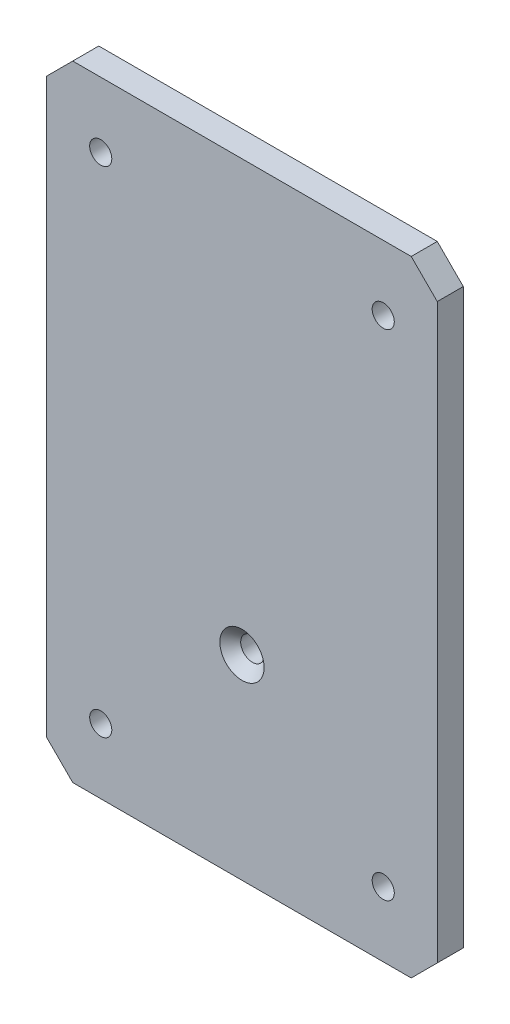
ISO-10303-21;
HEADER;
FILE_DESCRIPTION(('STEP AP214'),'2;1');
FILE_NAME('part.step','',(''),(''),'','','');
FILE_SCHEMA(('AUTOMOTIVE_DESIGN { 1 0 10303 214 1 1 1 1 }'));
ENDSEC;
DATA;
#1=APPLICATION_CONTEXT('core data for automotive mechanical design processes');
#2=APPLICATION_PROTOCOL_DEFINITION('international standard','automotive_design',2000,#1);
#3=PRODUCT_CONTEXT('',#1,'mechanical');
#4=PRODUCT('Part','Part','',(#3));
#5=PRODUCT_RELATED_PRODUCT_CATEGORY('part','',(#4));
#6=PRODUCT_DEFINITION_FORMATION('','',#4);
#7=PRODUCT_DEFINITION_CONTEXT('part definition',#1,'design');
#8=PRODUCT_DEFINITION('design','',#6,#7);
#9=PRODUCT_DEFINITION_SHAPE('','',#8);
#10=(LENGTH_UNIT() NAMED_UNIT(*) SI_UNIT(.MILLI.,.METRE.));
#11=(NAMED_UNIT(*) PLANE_ANGLE_UNIT() SI_UNIT($,.RADIAN.));
#12=(NAMED_UNIT(*) SI_UNIT($,.STERADIAN.) SOLID_ANGLE_UNIT());
#13=UNCERTAINTY_MEASURE_WITH_UNIT(LENGTH_MEASURE(1.E-05),#10,'distance_accuracy_value','');
#14=(GEOMETRIC_REPRESENTATION_CONTEXT(3) GLOBAL_UNCERTAINTY_ASSIGNED_CONTEXT((#13)) GLOBAL_UNIT_ASSIGNED_CONTEXT((#10,
#11,#12)) REPRESENTATION_CONTEXT('',''));
#15=CARTESIAN_POINT('',(0.,0.,0.));
#16=DIRECTION('',(0.,0.,1.));
#17=DIRECTION('',(1.,0.,0.));
#18=AXIS2_PLACEMENT_3D('',#15,#16,#17);
#19=CARTESIAN_POINT('',(150.,240.,10.));
#20=DIRECTION('',(0.,0.,-1.));
#21=DIRECTION('',(-1.,0.,0.));
#22=AXIS2_PLACEMENT_3D('',#19,#20,#21);
#23=PLANE('',#22);
#24=CARTESIAN_POINT('',(75.,75.,10.));
#25=DIRECTION('',(0.,0.,-1.));
#26=DIRECTION('',(-1.,0.,0.));
#27=AXIS2_PLACEMENT_3D('',#24,#25,#26);
#28=CIRCLE('',#27,8.50000000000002);
#29=CARTESIAN_POINT('',(66.5,75.,10.));
#30=VERTEX_POINT('',#29);
#31=EDGE_CURVE('E11',#30,#30,#28,.T.);
#32=ORIENTED_EDGE('',*,*,#31,.T.);
#33=EDGE_LOOP('',(#32));
#34=FACE_BOUND('',#33,.T.);
#35=CARTESIAN_POINT('',(129.25,25.,10.));
#36=DIRECTION('',(0.,0.,1.));
#37=DIRECTION('',(1.,0.,0.));
#38=AXIS2_PLACEMENT_3D('',#35,#36,#37);
#39=CIRCLE('',#38,4.25);
#40=CARTESIAN_POINT('',(133.5,25.,10.));
#41=VERTEX_POINT('',#40);
#42=EDGE_CURVE('E292',#41,#41,#39,.T.);
#43=ORIENTED_EDGE('',*,*,#42,.F.);
#44=EDGE_LOOP('',(#43));
#45=FACE_BOUND('',#44,.T.);
#46=CARTESIAN_POINT('',(129.25,215.,10.));
#47=DIRECTION('',(0.,0.,1.));
#48=DIRECTION('',(1.,0.,0.));
#49=AXIS2_PLACEMENT_3D('',#46,#47,#48);
#50=CIRCLE('',#49,4.25000000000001);
#51=CARTESIAN_POINT('',(133.5,215.,10.));
#52=VERTEX_POINT('',#51);
#53=EDGE_CURVE('E311',#52,#52,#50,.T.);
#54=ORIENTED_EDGE('',*,*,#53,.F.);
#55=EDGE_LOOP('',(#54));
#56=FACE_BOUND('',#55,.T.);
#57=DIRECTION('',(0.,1.,0.));
#58=VECTOR('',#57,1.);
#59=CARTESIAN_POINT('',(150.,10.,10.));
#60=LINE('',#59,#58);
#61=CARTESIAN_POINT('',(150.,10.,10.));
#62=VERTEX_POINT('',#61);
#63=CARTESIAN_POINT('',(150.,230.,10.));
#64=VERTEX_POINT('',#63);
#65=EDGE_CURVE('E134',#62,#64,#60,.T.);
#66=ORIENTED_EDGE('',*,*,#65,.T.);
#67=DIRECTION('',(-0.707106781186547,0.707106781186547,0.));
#68=VECTOR('',#67,1.);
#69=CARTESIAN_POINT('',(150.,230.,10.));
#70=LINE('',#69,#68);
#71=CARTESIAN_POINT('',(140.,240.,10.));
#72=VERTEX_POINT('',#71);
#73=EDGE_CURVE('E109',#64,#72,#70,.T.);
#74=ORIENTED_EDGE('',*,*,#73,.T.);
#75=DIRECTION('',(-1.,0.,0.));
#76=VECTOR('',#75,1.);
#77=CARTESIAN_POINT('',(10.,240.,10.));
#78=LINE('',#77,#76);
#79=CARTESIAN_POINT('',(10.,240.,10.));
#80=VERTEX_POINT('',#79);
#81=EDGE_CURVE('E137',#72,#80,#78,.T.);
#82=ORIENTED_EDGE('',*,*,#81,.T.);
#83=DIRECTION('',(-0.707106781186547,-0.707106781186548,0.));
#84=VECTOR('',#83,1.);
#85=CARTESIAN_POINT('',(0.,230.,10.));
#86=LINE('',#85,#84);
#87=CARTESIAN_POINT('',(0.,230.,10.));
#88=VERTEX_POINT('',#87);
#89=EDGE_CURVE('E139',#80,#88,#86,.T.);
#90=ORIENTED_EDGE('',*,*,#89,.T.);
#91=DIRECTION('',(0.,-1.,0.));
#92=VECTOR('',#91,1.);
#93=CARTESIAN_POINT('',(0.,10.,10.));
#94=LINE('',#93,#92);
#95=CARTESIAN_POINT('',(0.,10.,10.));
#96=VERTEX_POINT('',#95);
#97=EDGE_CURVE('E141',#88,#96,#94,.T.);
#98=ORIENTED_EDGE('',*,*,#97,.T.);
#99=DIRECTION('',(0.707106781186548,-0.707106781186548,0.));
#100=VECTOR('',#99,1.);
#101=CARTESIAN_POINT('',(10.,0.,10.));
#102=LINE('',#101,#100);
#103=CARTESIAN_POINT('',(10.,0.,10.));
#104=VERTEX_POINT('',#103);
#105=EDGE_CURVE('E143',#96,#104,#102,.T.);
#106=ORIENTED_EDGE('',*,*,#105,.T.);
#107=DIRECTION('',(1.,0.,0.));
#108=VECTOR('',#107,1.);
#109=CARTESIAN_POINT('',(10.,0.,10.));
#110=LINE('',#109,#108);
#111=CARTESIAN_POINT('',(140.,0.,10.));
#112=VERTEX_POINT('',#111);
#113=EDGE_CURVE('E48',#104,#112,#110,.T.);
#114=ORIENTED_EDGE('',*,*,#113,.T.);
#115=DIRECTION('',(0.707106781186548,0.707106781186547,0.));
#116=VECTOR('',#115,1.);
#117=CARTESIAN_POINT('',(140.,0.,10.));
#118=LINE('',#117,#116);
#119=EDGE_CURVE('E43',#112,#62,#118,.T.);
#120=ORIENTED_EDGE('',*,*,#119,.T.);
#121=EDGE_LOOP('',(#66,#74,#82,#90,#98,#106,#114,#120));
#122=FACE_BOUND('',#121,.T.);
#123=CARTESIAN_POINT('',(20.75,215.,10.));
#124=DIRECTION('',(0.,0.,1.));
#125=DIRECTION('',(1.,0.,0.));
#126=AXIS2_PLACEMENT_3D('',#123,#124,#125);
#127=CIRCLE('',#126,4.25);
#128=CARTESIAN_POINT('',(25.,215.,10.));
#129=VERTEX_POINT('',#128);
#130=EDGE_CURVE('E116',#129,#129,#127,.T.);
#131=ORIENTED_EDGE('',*,*,#130,.F.);
#132=EDGE_LOOP('',(#131));
#133=FACE_BOUND('',#132,.T.);
#134=CARTESIAN_POINT('',(20.75,25.,10.));
#135=DIRECTION('',(0.,0.,1.));
#136=DIRECTION('',(1.,0.,0.));
#137=AXIS2_PLACEMENT_3D('',#134,#135,#136);
#138=CIRCLE('',#137,4.25);
#139=CARTESIAN_POINT('',(25.,25.,10.));
#140=VERTEX_POINT('',#139);
#141=EDGE_CURVE('E305',#140,#140,#138,.T.);
#142=ORIENTED_EDGE('',*,*,#141,.F.);
#143=EDGE_LOOP('',(#142));
#144=FACE_BOUND('',#143,.T.);
#145=ADVANCED_FACE('F28',(#34,#45,#56,#122,#133,#144),#23,.F.);
#146=CARTESIAN_POINT('',(150.,240.,0.));
#147=DIRECTION('',(0.,0.,-1.));
#148=DIRECTION('',(-1.,0.,0.));
#149=AXIS2_PLACEMENT_3D('',#146,#147,#148);
#150=PLANE('',#149);
#151=CARTESIAN_POINT('',(129.25,25.,0.));
#152=DIRECTION('',(0.,0.,1.));
#153=DIRECTION('',(1.,0.,0.));
#154=AXIS2_PLACEMENT_3D('',#151,#152,#153);
#155=CIRCLE('',#154,4.25);
#156=CARTESIAN_POINT('',(133.5,25.,0.));
#157=VERTEX_POINT('',#156);
#158=EDGE_CURVE('E295',#157,#157,#155,.T.);
#159=ORIENTED_EDGE('',*,*,#158,.T.);
#160=EDGE_LOOP('',(#159));
#161=FACE_BOUND('',#160,.T.);
#162=CARTESIAN_POINT('',(129.25,215.,0.));
#163=DIRECTION('',(0.,0.,1.));
#164=DIRECTION('',(1.,0.,0.));
#165=AXIS2_PLACEMENT_3D('',#162,#163,#164);
#166=CIRCLE('',#165,4.25000000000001);
#167=CARTESIAN_POINT('',(133.5,215.,0.));
#168=VERTEX_POINT('',#167);
#169=EDGE_CURVE('E308',#168,#168,#166,.T.);
#170=ORIENTED_EDGE('',*,*,#169,.T.);
#171=EDGE_LOOP('',(#170));
#172=FACE_BOUND('',#171,.T.);
#173=DIRECTION('',(0.,1.,0.));
#174=VECTOR('',#173,1.);
#175=CARTESIAN_POINT('',(150.,10.,0.));
#176=LINE('',#175,#174);
#177=CARTESIAN_POINT('',(150.,10.,0.));
#178=VERTEX_POINT('',#177);
#179=CARTESIAN_POINT('',(150.,230.,0.));
#180=VERTEX_POINT('',#179);
#181=EDGE_CURVE('E99',#178,#180,#176,.T.);
#182=ORIENTED_EDGE('',*,*,#181,.F.);
#183=DIRECTION('',(0.707106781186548,0.707106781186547,0.));
#184=VECTOR('',#183,1.);
#185=CARTESIAN_POINT('',(140.,0.,0.));
#186=LINE('',#185,#184);
#187=CARTESIAN_POINT('',(140.,0.,0.));
#188=VERTEX_POINT('',#187);
#189=EDGE_CURVE('E132',#188,#178,#186,.T.);
#190=ORIENTED_EDGE('',*,*,#189,.F.);
#191=DIRECTION('',(1.,0.,0.));
#192=VECTOR('',#191,1.);
#193=CARTESIAN_POINT('',(10.,0.,0.));
#194=LINE('',#193,#192);
#195=CARTESIAN_POINT('',(10.,0.,0.));
#196=VERTEX_POINT('',#195);
#197=EDGE_CURVE('E130',#196,#188,#194,.T.);
#198=ORIENTED_EDGE('',*,*,#197,.F.);
#199=DIRECTION('',(0.707106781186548,-0.707106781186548,0.));
#200=VECTOR('',#199,1.);
#201=CARTESIAN_POINT('',(10.,0.,0.));
#202=LINE('',#201,#200);
#203=CARTESIAN_POINT('',(0.,10.,0.));
#204=VERTEX_POINT('',#203);
#205=EDGE_CURVE('E128',#204,#196,#202,.T.);
#206=ORIENTED_EDGE('',*,*,#205,.F.);
#207=DIRECTION('',(0.,-1.,0.));
#208=VECTOR('',#207,1.);
#209=CARTESIAN_POINT('',(0.,10.,0.));
#210=LINE('',#209,#208);
#211=CARTESIAN_POINT('',(0.,230.,0.));
#212=VERTEX_POINT('',#211);
#213=EDGE_CURVE('E126',#212,#204,#210,.T.);
#214=ORIENTED_EDGE('',*,*,#213,.F.);
#215=DIRECTION('',(-0.707106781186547,-0.707106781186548,0.));
#216=VECTOR('',#215,1.);
#217=CARTESIAN_POINT('',(0.,230.,0.));
#218=LINE('',#217,#216);
#219=CARTESIAN_POINT('',(10.,240.,0.));
#220=VERTEX_POINT('',#219);
#221=EDGE_CURVE('E124',#220,#212,#218,.T.);
#222=ORIENTED_EDGE('',*,*,#221,.F.);
#223=DIRECTION('',(-1.,0.,0.));
#224=VECTOR('',#223,1.);
#225=CARTESIAN_POINT('',(10.,240.,0.));
#226=LINE('',#225,#224);
#227=CARTESIAN_POINT('',(140.,240.,0.));
#228=VERTEX_POINT('',#227);
#229=EDGE_CURVE('E101',#228,#220,#226,.T.);
#230=ORIENTED_EDGE('',*,*,#229,.F.);
#231=DIRECTION('',(-0.707106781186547,0.707106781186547,0.));
#232=VECTOR('',#231,1.);
#233=CARTESIAN_POINT('',(150.,230.,0.));
#234=LINE('',#233,#232);
#235=EDGE_CURVE('E93',#180,#228,#234,.T.);
#236=ORIENTED_EDGE('',*,*,#235,.F.);
#237=EDGE_LOOP('',(#182,#190,#198,#206,#214,#222,#230,#236));
#238=FACE_BOUND('',#237,.T.);
#239=CARTESIAN_POINT('',(20.75,215.,0.));
#240=DIRECTION('',(0.,0.,1.));
#241=DIRECTION('',(1.,0.,0.));
#242=AXIS2_PLACEMENT_3D('',#239,#240,#241);
#243=CIRCLE('',#242,4.25);
#244=CARTESIAN_POINT('',(25.,215.,0.));
#245=VERTEX_POINT('',#244);
#246=EDGE_CURVE('E119',#245,#245,#243,.T.);
#247=ORIENTED_EDGE('',*,*,#246,.T.);
#248=EDGE_LOOP('',(#247));
#249=FACE_BOUND('',#248,.T.);
#250=CARTESIAN_POINT('',(20.75,25.,0.));
#251=DIRECTION('',(0.,0.,1.));
#252=DIRECTION('',(1.,0.,0.));
#253=AXIS2_PLACEMENT_3D('',#250,#251,#252);
#254=CIRCLE('',#253,4.25);
#255=CARTESIAN_POINT('',(25.,25.,0.));
#256=VERTEX_POINT('',#255);
#257=EDGE_CURVE('E298',#256,#256,#254,.T.);
#258=ORIENTED_EDGE('',*,*,#257,.T.);
#259=EDGE_LOOP('',(#258));
#260=FACE_BOUND('',#259,.T.);
#261=CARTESIAN_POINT('',(75.,75.,0.));
#262=DIRECTION('',(0.,0.,1.));
#263=DIRECTION('',(1.,0.,0.));
#264=AXIS2_PLACEMENT_3D('',#261,#262,#263);
#265=CIRCLE('',#264,4.50000000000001);
#266=CARTESIAN_POINT('',(79.5,75.,0.));
#267=VERTEX_POINT('',#266);
#268=EDGE_CURVE('E296',#267,#267,#265,.T.);
#269=ORIENTED_EDGE('',*,*,#268,.T.);
#270=EDGE_LOOP('',(#269));
#271=FACE_BOUND('',#270,.T.);
#272=ADVANCED_FACE('F95',(#161,#172,#238,#249,#260,#271),#150,.T.);
#273=CARTESIAN_POINT('',(150.,10.,10.));
#274=DIRECTION('',(-1.,0.,0.));
#275=DIRECTION('',(0.,0.,1.));
#276=AXIS2_PLACEMENT_3D('',#273,#274,#275);
#277=PLANE('',#276);
#278=ORIENTED_EDGE('',*,*,#181,.T.);
#279=DIRECTION('',(0.,0.,-1.));
#280=VECTOR('',#279,1.);
#281=CARTESIAN_POINT('',(150.,230.,10.));
#282=LINE('',#281,#280);
#283=EDGE_CURVE('E107',#64,#180,#282,.T.);
#284=ORIENTED_EDGE('',*,*,#283,.F.);
#285=ORIENTED_EDGE('',*,*,#65,.F.);
#286=DIRECTION('',(0.,0.,-1.));
#287=VECTOR('',#286,1.);
#288=CARTESIAN_POINT('',(150.,10.,10.));
#289=LINE('',#288,#287);
#290=EDGE_CURVE('E115',#62,#178,#289,.T.);
#291=ORIENTED_EDGE('',*,*,#290,.T.);
#292=EDGE_LOOP('',(#278,#284,#285,#291));
#293=FACE_BOUND('',#292,.T.);
#294=ADVANCED_FACE('F30',(#293),#277,.F.);
#295=CARTESIAN_POINT('',(150.,230.,10.));
#296=DIRECTION('',(-0.707106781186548,-0.707106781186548,0.));
#297=DIRECTION('',(0.707106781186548,-0.707106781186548,0.));
#298=AXIS2_PLACEMENT_3D('',#295,#296,#297);
#299=PLANE('',#298);
#300=ORIENTED_EDGE('',*,*,#235,.T.);
#301=DIRECTION('',(0.,0.,-1.));
#302=VECTOR('',#301,1.);
#303=CARTESIAN_POINT('',(140.,240.,10.));
#304=LINE('',#303,#302);
#305=EDGE_CURVE('E112',#72,#228,#304,.T.);
#306=ORIENTED_EDGE('',*,*,#305,.F.);
#307=ORIENTED_EDGE('',*,*,#73,.F.);
#308=ORIENTED_EDGE('',*,*,#283,.T.);
#309=EDGE_LOOP('',(#300,#306,#307,#308));
#310=FACE_BOUND('',#309,.T.);
#311=ADVANCED_FACE('F108',(#310),#299,.F.);
#312=CARTESIAN_POINT('',(10.,240.,10.));
#313=DIRECTION('',(0.,-1.,0.));
#314=DIRECTION('',(0.,0.,-1.));
#315=AXIS2_PLACEMENT_3D('',#312,#313,#314);
#316=PLANE('',#315);
#317=ORIENTED_EDGE('',*,*,#229,.T.);
#318=DIRECTION('',(0.,0.,-1.));
#319=VECTOR('',#318,1.);
#320=CARTESIAN_POINT('',(10.,240.,10.));
#321=LINE('',#320,#319);
#322=EDGE_CURVE('E160',#80,#220,#321,.T.);
#323=ORIENTED_EDGE('',*,*,#322,.F.);
#324=ORIENTED_EDGE('',*,*,#81,.F.);
#325=ORIENTED_EDGE('',*,*,#305,.T.);
#326=EDGE_LOOP('',(#317,#323,#324,#325));
#327=FACE_BOUND('',#326,.T.);
#328=ADVANCED_FACE('F211',(#327),#316,.F.);
#329=CARTESIAN_POINT('',(0.,230.,10.));
#330=DIRECTION('',(0.707106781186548,-0.707106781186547,0.));
#331=DIRECTION('',(0.707106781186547,0.707106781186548,0.));
#332=AXIS2_PLACEMENT_3D('',#329,#330,#331);
#333=PLANE('',#332);
#334=ORIENTED_EDGE('',*,*,#221,.T.);
#335=DIRECTION('',(0.,0.,-1.));
#336=VECTOR('',#335,1.);
#337=CARTESIAN_POINT('',(0.,230.,10.));
#338=LINE('',#337,#336);
#339=EDGE_CURVE('E157',#88,#212,#338,.T.);
#340=ORIENTED_EDGE('',*,*,#339,.F.);
#341=ORIENTED_EDGE('',*,*,#89,.F.);
#342=ORIENTED_EDGE('',*,*,#322,.T.);
#343=EDGE_LOOP('',(#334,#340,#341,#342));
#344=FACE_BOUND('',#343,.T.);
#345=ADVANCED_FACE('F207',(#344),#333,.F.);
#346=CARTESIAN_POINT('',(0.,10.,10.));
#347=DIRECTION('',(1.,0.,0.));
#348=DIRECTION('',(0.,0.,-1.));
#349=AXIS2_PLACEMENT_3D('',#346,#347,#348);
#350=PLANE('',#349);
#351=ORIENTED_EDGE('',*,*,#213,.T.);
#352=DIRECTION('',(0.,0.,-1.));
#353=VECTOR('',#352,1.);
#354=CARTESIAN_POINT('',(0.,10.,10.));
#355=LINE('',#354,#353);
#356=EDGE_CURVE('E154',#96,#204,#355,.T.);
#357=ORIENTED_EDGE('',*,*,#356,.F.);
#358=ORIENTED_EDGE('',*,*,#97,.F.);
#359=ORIENTED_EDGE('',*,*,#339,.T.);
#360=EDGE_LOOP('',(#351,#357,#358,#359));
#361=FACE_BOUND('',#360,.T.);
#362=ADVANCED_FACE('F203',(#361),#350,.F.);
#363=CARTESIAN_POINT('',(10.,0.,10.));
#364=DIRECTION('',(0.707106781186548,0.707106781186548,0.));
#365=DIRECTION('',(-0.707106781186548,0.707106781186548,0.));
#366=AXIS2_PLACEMENT_3D('',#363,#364,#365);
#367=PLANE('',#366);
#368=ORIENTED_EDGE('',*,*,#205,.T.);
#369=DIRECTION('',(0.,0.,-1.));
#370=VECTOR('',#369,1.);
#371=CARTESIAN_POINT('',(10.,0.,10.));
#372=LINE('',#371,#370);
#373=EDGE_CURVE('E151',#104,#196,#372,.T.);
#374=ORIENTED_EDGE('',*,*,#373,.F.);
#375=ORIENTED_EDGE('',*,*,#105,.F.);
#376=ORIENTED_EDGE('',*,*,#356,.T.);
#377=EDGE_LOOP('',(#368,#374,#375,#376));
#378=FACE_BOUND('',#377,.T.);
#379=ADVANCED_FACE('F199',(#378),#367,.F.);
#380=CARTESIAN_POINT('',(10.,0.,10.));
#381=DIRECTION('',(0.,1.,0.));
#382=DIRECTION('',(0.,0.,1.));
#383=AXIS2_PLACEMENT_3D('',#380,#381,#382);
#384=PLANE('',#383);
#385=ORIENTED_EDGE('',*,*,#197,.T.);
#386=DIRECTION('',(0.,0.,-1.));
#387=VECTOR('',#386,1.);
#388=CARTESIAN_POINT('',(140.,0.,10.));
#389=LINE('',#388,#387);
#390=EDGE_CURVE('E148',#112,#188,#389,.T.);
#391=ORIENTED_EDGE('',*,*,#390,.F.);
#392=ORIENTED_EDGE('',*,*,#113,.F.);
#393=ORIENTED_EDGE('',*,*,#373,.T.);
#394=EDGE_LOOP('',(#385,#391,#392,#393));
#395=FACE_BOUND('',#394,.T.);
#396=ADVANCED_FACE('F195',(#395),#384,.F.);
#397=CARTESIAN_POINT('',(140.,0.,10.));
#398=DIRECTION('',(-0.707106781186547,0.707106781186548,0.));
#399=DIRECTION('',(-0.707106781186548,-0.707106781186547,0.));
#400=AXIS2_PLACEMENT_3D('',#397,#398,#399);
#401=PLANE('',#400);
#402=ORIENTED_EDGE('',*,*,#189,.T.);
#403=ORIENTED_EDGE('',*,*,#290,.F.);
#404=ORIENTED_EDGE('',*,*,#119,.F.);
#405=ORIENTED_EDGE('',*,*,#390,.T.);
#406=EDGE_LOOP('',(#402,#403,#404,#405));
#407=FACE_BOUND('',#406,.T.);
#408=ADVANCED_FACE('F191',(#407),#401,.F.);
#409=CARTESIAN_POINT('',(20.75,215.,10.));
#410=DIRECTION('',(0.,0.,-1.));
#411=DIRECTION('',(-1.,0.,0.));
#412=AXIS2_PLACEMENT_3D('',#409,#410,#411);
#413=CYLINDRICAL_SURFACE('',#412,4.25);
#414=ORIENTED_EDGE('',*,*,#130,.T.);
#415=EDGE_LOOP('',(#414));
#416=FACE_BOUND('',#415,.T.);
#417=ORIENTED_EDGE('',*,*,#246,.F.);
#418=EDGE_LOOP('',(#417));
#419=FACE_BOUND('',#418,.T.);
#420=ADVANCED_FACE('F194',(#416,#419),#413,.F.);
#421=CARTESIAN_POINT('',(129.25,215.,10.));
#422=DIRECTION('',(0.,0.,-1.));
#423=DIRECTION('',(-1.,0.,0.));
#424=AXIS2_PLACEMENT_3D('',#421,#422,#423);
#425=CYLINDRICAL_SURFACE('',#424,4.25000000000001);
#426=ORIENTED_EDGE('',*,*,#53,.T.);
#427=EDGE_LOOP('',(#426));
#428=FACE_BOUND('',#427,.T.);
#429=ORIENTED_EDGE('',*,*,#169,.F.);
#430=EDGE_LOOP('',(#429));
#431=FACE_BOUND('',#430,.T.);
#432=ADVANCED_FACE('F260',(#428,#431),#425,.F.);
#433=CARTESIAN_POINT('',(20.75,25.,10.));
#434=DIRECTION('',(0.,0.,-1.));
#435=DIRECTION('',(-1.,0.,0.));
#436=AXIS2_PLACEMENT_3D('',#433,#434,#435);
#437=CYLINDRICAL_SURFACE('',#436,4.25);
#438=ORIENTED_EDGE('',*,*,#141,.T.);
#439=EDGE_LOOP('',(#438));
#440=FACE_BOUND('',#439,.T.);
#441=ORIENTED_EDGE('',*,*,#257,.F.);
#442=EDGE_LOOP('',(#441));
#443=FACE_BOUND('',#442,.T.);
#444=ADVANCED_FACE('F267',(#440,#443),#437,.F.);
#445=CARTESIAN_POINT('',(129.25,25.,10.));
#446=DIRECTION('',(0.,0.,-1.));
#447=DIRECTION('',(-1.,0.,0.));
#448=AXIS2_PLACEMENT_3D('',#445,#446,#447);
#449=CYLINDRICAL_SURFACE('',#448,4.25);
#450=ORIENTED_EDGE('',*,*,#42,.T.);
#451=EDGE_LOOP('',(#450));
#452=FACE_BOUND('',#451,.T.);
#453=ORIENTED_EDGE('',*,*,#158,.F.);
#454=EDGE_LOOP('',(#453));
#455=FACE_BOUND('',#454,.T.);
#456=ADVANCED_FACE('F176',(#452,#455),#449,.F.);
#457=CARTESIAN_POINT('',(75.,75.,10.));
#458=DIRECTION('',(0.,0.,-1.));
#459=DIRECTION('',(-1.,0.,0.));
#460=AXIS2_PLACEMENT_3D('',#457,#458,#459);
#461=CYLINDRICAL_SURFACE('',#460,4.50000000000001);
#462=CARTESIAN_POINT('',(75.,75.,6.));
#463=DIRECTION('',(0.,0.,-1.));
#464=DIRECTION('',(-1.,0.,0.));
#465=AXIS2_PLACEMENT_3D('',#462,#463,#464);
#466=CIRCLE('',#465,4.50000000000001);
#467=CARTESIAN_POINT('',(70.5,75.,6.));
#468=VERTEX_POINT('',#467);
#469=EDGE_CURVE('E36',#468,#468,#466,.F.);
#470=ORIENTED_EDGE('',*,*,#469,.T.);
#471=EDGE_LOOP('',(#470));
#472=FACE_BOUND('',#471,.T.);
#473=ORIENTED_EDGE('',*,*,#268,.F.);
#474=EDGE_LOOP('',(#473));
#475=FACE_BOUND('',#474,.T.);
#476=ADVANCED_FACE('F166',(#472,#475),#461,.F.);
#477=CARTESIAN_POINT('',(75.,75.,6.));
#478=DIRECTION('',(0.,0.,1.));
#479=DIRECTION('',(1.,0.,0.));
#480=AXIS2_PLACEMENT_3D('',#477,#478,#479);
#481=CONICAL_SURFACE('',#480,4.50000000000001,0.78539816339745);
#482=ORIENTED_EDGE('',*,*,#31,.F.);
#483=EDGE_LOOP('',(#482));
#484=FACE_BOUND('',#483,.T.);
#485=ORIENTED_EDGE('',*,*,#469,.F.);
#486=EDGE_LOOP('',(#485));
#487=FACE_BOUND('',#486,.T.);
#488=ADVANCED_FACE('F169',(#484,#487),#481,.F.);
#489=CLOSED_SHELL('',(#145,#272,#294,#311,#328,#345,#362,#379,#396,#408,#420,#432,#444,#456,
#476,#488));
#490=MANIFOLD_SOLID_BREP('B2',#489);
#491=ADVANCED_BREP_SHAPE_REPRESENTATION('',(#18,#490),#14);
#492=SHAPE_DEFINITION_REPRESENTATION(#9,#491);
ENDSEC;
END-ISO-10303-21;
